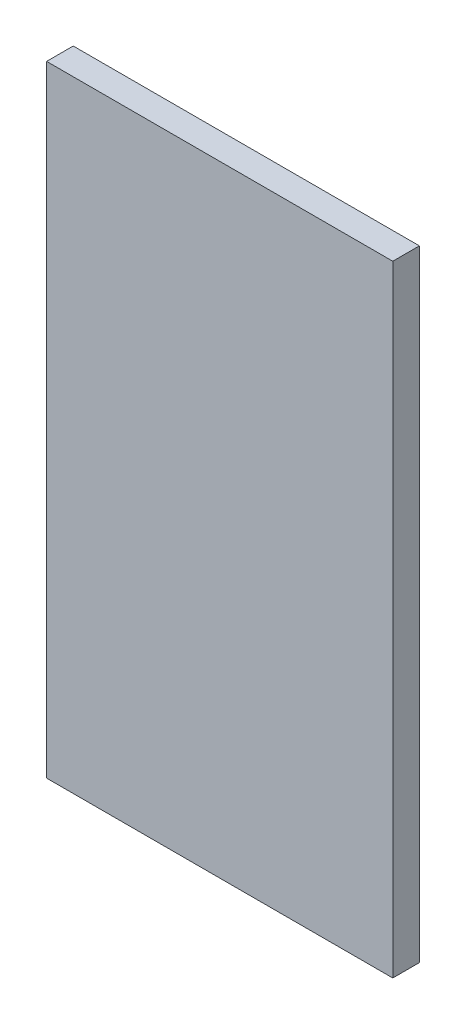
from build123d import *

# Parameters (mm, degrees)
SKETCH_1_W      = 208
SKETCH_1_H      = 373
EXTRUDE_1_DEPTH = 16


with BuildPart() as part:
    # Sketch 1 → Extrude 1 (new body)
    with BuildSketch(Plane.XY):
        with Locations((104, -186.5)):
            Rectangle(SKETCH_1_W, SKETCH_1_H)
    extrude(amount=EXTRUDE_1_DEPTH)


solid = part.part
